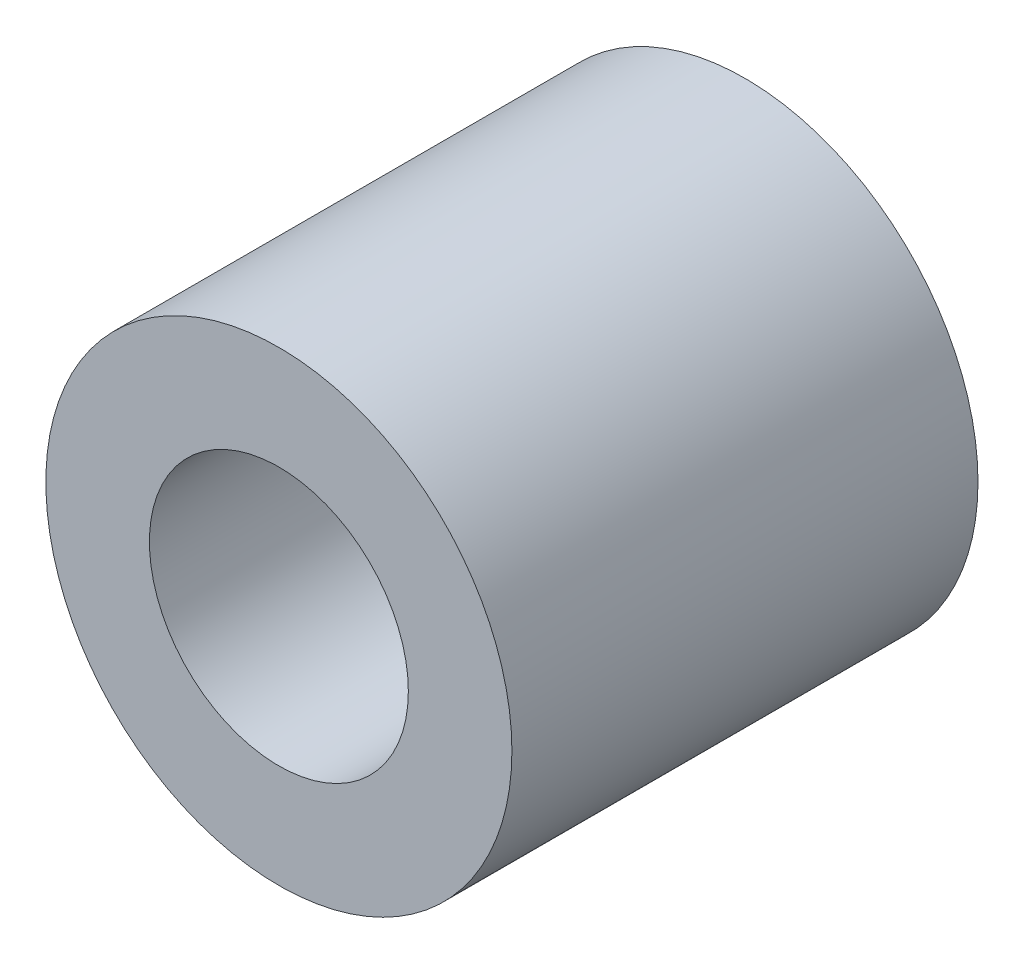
from build123d import *

# Parameters (mm, degrees)
SKETCH1_R          = 4.5
INSERT_SHAPE_DEPTH = 9
SKETCH3_R          = 2.5
CENTER_HOLE_DEPTH  = 4.3
TAPPED_HOLE_REACH  = 9.911
SKETCH4_R          = 1.75


with BuildPart() as part:
    # Sketch1 → insert shape (new body)
    with BuildSketch(Plane.XY):
        Circle(SKETCH1_R)
    extrude(amount=INSERT_SHAPE_DEPTH)

    # Sketch3 → center hole (cut)
    with BuildSketch(Plane.XY.offset(9)):
        Circle(SKETCH3_R)
    extrude(amount=-CENTER_HOLE_DEPTH, mode=Mode.SUBTRACT)

    # Sketch4 → tapped hole (cut, up to next)
    with BuildSketch(Plane.XY.offset(4.7), mode=Mode.PRIVATE) as tapped_hole_sk1:
        Circle(SKETCH4_R)
    tapped_hole_tool1 = extrude(tapped_hole_sk1.sketch, amount=-TAPPED_HOLE_REACH, mode=Mode.PRIVATE) & part.part
    add(tapped_hole_tool1.solids().sort_by_distance((0, 0, 4.7))[0], mode=Mode.SUBTRACT)


solid = part.part
